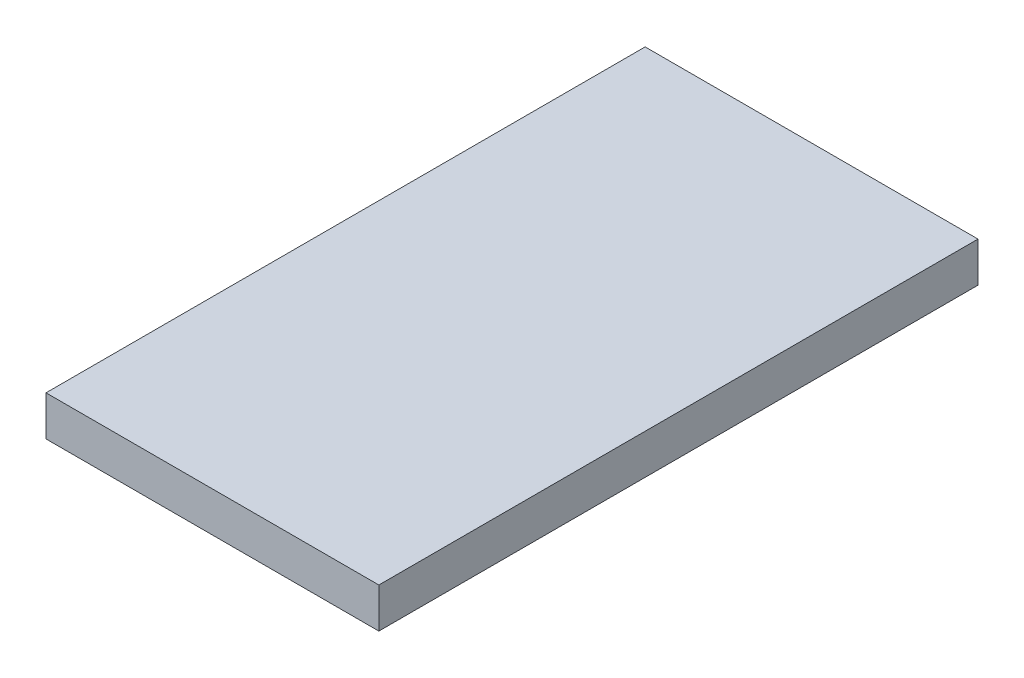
ISO-10303-21;
HEADER;
FILE_DESCRIPTION(('STEP AP214'),'2;1');
FILE_NAME('part.step','',(''),(''),'','','');
FILE_SCHEMA(('AUTOMOTIVE_DESIGN { 1 0 10303 214 1 1 1 1 }'));
ENDSEC;
DATA;
#1=APPLICATION_CONTEXT('core data for automotive mechanical design processes');
#2=APPLICATION_PROTOCOL_DEFINITION('international standard','automotive_design',2000,#1);
#3=PRODUCT_CONTEXT('',#1,'mechanical');
#4=PRODUCT('Part','Part','',(#3));
#5=PRODUCT_RELATED_PRODUCT_CATEGORY('part','',(#4));
#6=PRODUCT_DEFINITION_FORMATION('','',#4);
#7=PRODUCT_DEFINITION_CONTEXT('part definition',#1,'design');
#8=PRODUCT_DEFINITION('design','',#6,#7);
#9=PRODUCT_DEFINITION_SHAPE('','',#8);
#10=(LENGTH_UNIT() NAMED_UNIT(*) SI_UNIT(.MILLI.,.METRE.));
#11=(NAMED_UNIT(*) PLANE_ANGLE_UNIT() SI_UNIT($,.RADIAN.));
#12=(NAMED_UNIT(*) SI_UNIT($,.STERADIAN.) SOLID_ANGLE_UNIT());
#13=UNCERTAINTY_MEASURE_WITH_UNIT(LENGTH_MEASURE(1.E-05),#10,'distance_accuracy_value','');
#14=(GEOMETRIC_REPRESENTATION_CONTEXT(3) GLOBAL_UNCERTAINTY_ASSIGNED_CONTEXT((#13)) GLOBAL_UNIT_ASSIGNED_CONTEXT((#10,
#11,#12)) REPRESENTATION_CONTEXT('',''));
#15=CARTESIAN_POINT('',(0.,0.,0.));
#16=DIRECTION('',(0.,0.,1.));
#17=DIRECTION('',(1.,0.,0.));
#18=AXIS2_PLACEMENT_3D('',#15,#16,#17);
#19=CARTESIAN_POINT('',(0.,6.,0.));
#20=DIRECTION('',(-1.,0.,0.));
#21=DIRECTION('',(0.,0.,1.));
#22=AXIS2_PLACEMENT_3D('',#19,#20,#21);
#23=PLANE('',#22);
#24=DIRECTION('',(0.,0.,-1.));
#25=VECTOR('',#24,1.);
#26=CARTESIAN_POINT('',(0.,0.,0.));
#27=LINE('',#26,#25);
#28=CARTESIAN_POINT('',(0.,0.,0.));
#29=VERTEX_POINT('',#28);
#30=CARTESIAN_POINT('',(0.,0.,-90.));
#31=VERTEX_POINT('',#30);
#32=EDGE_CURVE('E95',#29,#31,#27,.T.);
#33=ORIENTED_EDGE('',*,*,#32,.T.);
#34=DIRECTION('',(0.,-1.,0.));
#35=VECTOR('',#34,1.);
#36=CARTESIAN_POINT('',(0.,6.,-90.));
#37=LINE('',#36,#35);
#38=CARTESIAN_POINT('',(0.,6.,-90.));
#39=VERTEX_POINT('',#38);
#40=EDGE_CURVE('E11',#39,#31,#37,.T.);
#41=ORIENTED_EDGE('',*,*,#40,.F.);
#42=DIRECTION('',(0.,0.,-1.));
#43=VECTOR('',#42,1.);
#44=CARTESIAN_POINT('',(0.,6.,0.));
#45=LINE('',#44,#43);
#46=CARTESIAN_POINT('',(0.,6.,0.));
#47=VERTEX_POINT('',#46);
#48=EDGE_CURVE('E83',#47,#39,#45,.T.);
#49=ORIENTED_EDGE('',*,*,#48,.F.);
#50=DIRECTION('',(0.,-1.,0.));
#51=VECTOR('',#50,1.);
#52=CARTESIAN_POINT('',(0.,6.,0.));
#53=LINE('',#52,#51);
#54=EDGE_CURVE('E91',#47,#29,#53,.T.);
#55=ORIENTED_EDGE('',*,*,#54,.T.);
#56=EDGE_LOOP('',(#33,#41,#49,#55));
#57=FACE_BOUND('',#56,.T.);
#58=ADVANCED_FACE('F32',(#57),#23,.F.);
#59=CARTESIAN_POINT('',(0.,6.,-90.));
#60=DIRECTION('',(0.,0.,1.));
#61=DIRECTION('',(1.,0.,0.));
#62=AXIS2_PLACEMENT_3D('',#59,#60,#61);
#63=PLANE('',#62);
#64=DIRECTION('',(-1.,0.,0.));
#65=VECTOR('',#64,1.);
#66=CARTESIAN_POINT('',(0.,0.,-90.));
#67=LINE('',#66,#65);
#68=CARTESIAN_POINT('',(-50.,0.,-90.));
#69=VERTEX_POINT('',#68);
#70=EDGE_CURVE('E87',#31,#69,#67,.T.);
#71=ORIENTED_EDGE('',*,*,#70,.T.);
#72=DIRECTION('',(0.,-1.,0.));
#73=VECTOR('',#72,1.);
#74=CARTESIAN_POINT('',(-50.,6.,-90.));
#75=LINE('',#74,#73);
#76=CARTESIAN_POINT('',(-50.,6.,-90.));
#77=VERTEX_POINT('',#76);
#78=EDGE_CURVE('E40',#77,#69,#75,.T.);
#79=ORIENTED_EDGE('',*,*,#78,.F.);
#80=DIRECTION('',(-1.,0.,0.));
#81=VECTOR('',#80,1.);
#82=CARTESIAN_POINT('',(0.,6.,-90.));
#83=LINE('',#82,#81);
#84=EDGE_CURVE('E78',#39,#77,#83,.T.);
#85=ORIENTED_EDGE('',*,*,#84,.F.);
#86=ORIENTED_EDGE('',*,*,#40,.T.);
#87=EDGE_LOOP('',(#71,#79,#85,#86));
#88=FACE_BOUND('',#87,.T.);
#89=ADVANCED_FACE('F86',(#88),#63,.F.);
#90=CARTESIAN_POINT('',(-50.,6.,0.));
#91=DIRECTION('',(1.,0.,0.));
#92=DIRECTION('',(0.,0.,-1.));
#93=AXIS2_PLACEMENT_3D('',#90,#91,#92);
#94=PLANE('',#93);
#95=DIRECTION('',(0.,0.,1.));
#96=VECTOR('',#95,1.);
#97=CARTESIAN_POINT('',(-50.,0.,0.));
#98=LINE('',#97,#96);
#99=CARTESIAN_POINT('',(-50.,0.,0.));
#100=VERTEX_POINT('',#99);
#101=EDGE_CURVE('E65',#69,#100,#98,.T.);
#102=ORIENTED_EDGE('',*,*,#101,.T.);
#103=DIRECTION('',(0.,-1.,0.));
#104=VECTOR('',#103,1.);
#105=CARTESIAN_POINT('',(-50.,6.,0.));
#106=LINE('',#105,#104);
#107=CARTESIAN_POINT('',(-50.,6.,0.));
#108=VERTEX_POINT('',#107);
#109=EDGE_CURVE('E88',#108,#100,#106,.T.);
#110=ORIENTED_EDGE('',*,*,#109,.F.);
#111=DIRECTION('',(0.,0.,1.));
#112=VECTOR('',#111,1.);
#113=CARTESIAN_POINT('',(-50.,6.,0.));
#114=LINE('',#113,#112);
#115=EDGE_CURVE('E81',#77,#108,#114,.T.);
#116=ORIENTED_EDGE('',*,*,#115,.F.);
#117=ORIENTED_EDGE('',*,*,#78,.T.);
#118=EDGE_LOOP('',(#102,#110,#116,#117));
#119=FACE_BOUND('',#118,.T.);
#120=ADVANCED_FACE('F89',(#119),#94,.F.);
#121=CARTESIAN_POINT('',(0.,6.,0.));
#122=DIRECTION('',(0.,0.,-1.));
#123=DIRECTION('',(-1.,0.,0.));
#124=AXIS2_PLACEMENT_3D('',#121,#122,#123);
#125=PLANE('',#124);
#126=DIRECTION('',(1.,0.,0.));
#127=VECTOR('',#126,1.);
#128=CARTESIAN_POINT('',(0.,0.,0.));
#129=LINE('',#128,#127);
#130=EDGE_CURVE('E71',#100,#29,#129,.T.);
#131=ORIENTED_EDGE('',*,*,#130,.T.);
#132=ORIENTED_EDGE('',*,*,#54,.F.);
#133=DIRECTION('',(1.,0.,0.));
#134=VECTOR('',#133,1.);
#135=CARTESIAN_POINT('',(0.,6.,0.));
#136=LINE('',#135,#134);
#137=EDGE_CURVE('E48',#108,#47,#136,.T.);
#138=ORIENTED_EDGE('',*,*,#137,.F.);
#139=ORIENTED_EDGE('',*,*,#109,.T.);
#140=EDGE_LOOP('',(#131,#132,#138,#139));
#141=FACE_BOUND('',#140,.T.);
#142=ADVANCED_FACE('F102',(#141),#125,.F.);
#143=CARTESIAN_POINT('',(0.,6.,0.));
#144=DIRECTION('',(0.,1.,0.));
#145=DIRECTION('',(0.,0.,1.));
#146=AXIS2_PLACEMENT_3D('',#143,#144,#145);
#147=PLANE('',#146);
#148=ORIENTED_EDGE('',*,*,#48,.T.);
#149=ORIENTED_EDGE('',*,*,#84,.T.);
#150=ORIENTED_EDGE('',*,*,#115,.T.);
#151=ORIENTED_EDGE('',*,*,#137,.T.);
#152=EDGE_LOOP('',(#148,#149,#150,#151));
#153=FACE_BOUND('',#152,.T.);
#154=ADVANCED_FACE('F79',(#153),#147,.T.);
#155=CARTESIAN_POINT('',(0.,0.,0.));
#156=DIRECTION('',(0.,1.,0.));
#157=DIRECTION('',(0.,0.,1.));
#158=AXIS2_PLACEMENT_3D('',#155,#156,#157);
#159=PLANE('',#158);
#160=ORIENTED_EDGE('',*,*,#32,.F.);
#161=ORIENTED_EDGE('',*,*,#130,.F.);
#162=ORIENTED_EDGE('',*,*,#101,.F.);
#163=ORIENTED_EDGE('',*,*,#70,.F.);
#164=EDGE_LOOP('',(#160,#161,#162,#163));
#165=FACE_BOUND('',#164,.T.);
#166=ADVANCED_FACE('F105',(#165),#159,.F.);
#167=CLOSED_SHELL('',(#58,#89,#120,#142,#154,#166));
#168=MANIFOLD_SOLID_BREP('B2',#167);
#169=ADVANCED_BREP_SHAPE_REPRESENTATION('',(#18,#168),#14);
#170=SHAPE_DEFINITION_REPRESENTATION(#9,#169);
ENDSEC;
END-ISO-10303-21;
